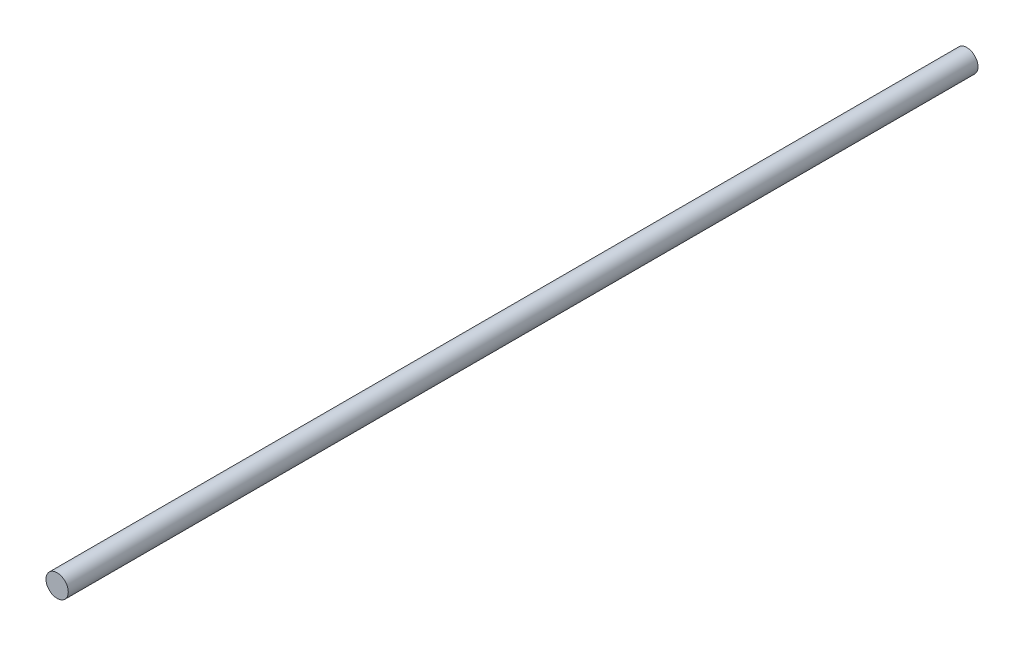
ISO-10303-21;
HEADER;
FILE_DESCRIPTION(('STEP AP214'),'2;1');
FILE_NAME('part.step','',(''),(''),'','','');
FILE_SCHEMA(('AUTOMOTIVE_DESIGN { 1 0 10303 214 1 1 1 1 }'));
ENDSEC;
DATA;
#1=APPLICATION_CONTEXT('core data for automotive mechanical design processes');
#2=APPLICATION_PROTOCOL_DEFINITION('international standard','automotive_design',2000,#1);
#3=PRODUCT_CONTEXT('',#1,'mechanical');
#4=PRODUCT('Part','Part','',(#3));
#5=PRODUCT_RELATED_PRODUCT_CATEGORY('part','',(#4));
#6=PRODUCT_DEFINITION_FORMATION('','',#4);
#7=PRODUCT_DEFINITION_CONTEXT('part definition',#1,'design');
#8=PRODUCT_DEFINITION('design','',#6,#7);
#9=PRODUCT_DEFINITION_SHAPE('','',#8);
#10=(LENGTH_UNIT() NAMED_UNIT(*) SI_UNIT(.MILLI.,.METRE.));
#11=(NAMED_UNIT(*) PLANE_ANGLE_UNIT() SI_UNIT($,.RADIAN.));
#12=(NAMED_UNIT(*) SI_UNIT($,.STERADIAN.) SOLID_ANGLE_UNIT());
#13=UNCERTAINTY_MEASURE_WITH_UNIT(LENGTH_MEASURE(1.E-05),#10,'distance_accuracy_value','');
#14=(GEOMETRIC_REPRESENTATION_CONTEXT(3) GLOBAL_UNCERTAINTY_ASSIGNED_CONTEXT((#13)) GLOBAL_UNIT_ASSIGNED_CONTEXT((#10,
#11,#12)) REPRESENTATION_CONTEXT('',''));
#15=CARTESIAN_POINT('',(0.,0.,0.));
#16=DIRECTION('',(0.,0.,1.));
#17=DIRECTION('',(1.,0.,0.));
#18=AXIS2_PLACEMENT_3D('',#15,#16,#17);
#19=CARTESIAN_POINT('',(80.,15.,-200.));
#20=DIRECTION('',(0.,0.,1.));
#21=DIRECTION('',(1.,0.,0.));
#22=AXIS2_PLACEMENT_3D('',#19,#20,#21);
#23=CYLINDRICAL_SURFACE('',#22,4.9);
#24=CARTESIAN_POINT('',(80.,15.,-200.));
#25=DIRECTION('',(0.,0.,1.));
#26=DIRECTION('',(1.,0.,0.));
#27=AXIS2_PLACEMENT_3D('',#24,#25,#26);
#28=CIRCLE('',#27,4.9);
#29=CARTESIAN_POINT('',(84.9,15.,-200.));
#30=VERTEX_POINT('',#29);
#31=EDGE_CURVE('E10',#30,#30,#28,.T.);
#32=ORIENTED_EDGE('',*,*,#31,.T.);
#33=EDGE_LOOP('',(#32));
#34=FACE_BOUND('',#33,.T.);
#35=CARTESIAN_POINT('',(80.,15.,200.));
#36=DIRECTION('',(0.,0.,1.));
#37=DIRECTION('',(1.,0.,0.));
#38=AXIS2_PLACEMENT_3D('',#35,#36,#37);
#39=CIRCLE('',#38,4.9);
#40=CARTESIAN_POINT('',(84.9,15.,200.));
#41=VERTEX_POINT('',#40);
#42=EDGE_CURVE('E38',#41,#41,#39,.T.);
#43=ORIENTED_EDGE('',*,*,#42,.F.);
#44=EDGE_LOOP('',(#43));
#45=FACE_BOUND('',#44,.T.);
#46=ADVANCED_FACE('F32',(#34,#45),#23,.T.);
#47=CARTESIAN_POINT('',(80.,15.,-200.));
#48=DIRECTION('',(0.,0.,1.));
#49=DIRECTION('',(1.,0.,0.));
#50=AXIS2_PLACEMENT_3D('',#47,#48,#49);
#51=PLANE('',#50);
#52=ORIENTED_EDGE('',*,*,#31,.F.);
#53=EDGE_LOOP('',(#52));
#54=FACE_BOUND('',#53,.T.);
#55=ADVANCED_FACE('F47',(#54),#51,.F.);
#56=CARTESIAN_POINT('',(80.,15.,200.));
#57=DIRECTION('',(0.,0.,1.));
#58=DIRECTION('',(1.,0.,0.));
#59=AXIS2_PLACEMENT_3D('',#56,#57,#58);
#60=PLANE('',#59);
#61=ORIENTED_EDGE('',*,*,#42,.T.);
#62=EDGE_LOOP('',(#61));
#63=FACE_BOUND('',#62,.T.);
#64=ADVANCED_FACE('F44',(#63),#60,.T.);
#65=CLOSED_SHELL('',(#46,#55,#64));
#66=MANIFOLD_SOLID_BREP('B2',#65);
#67=ADVANCED_BREP_SHAPE_REPRESENTATION('',(#18,#66),#14);
#68=SHAPE_DEFINITION_REPRESENTATION(#9,#67);
ENDSEC;
END-ISO-10303-21;
